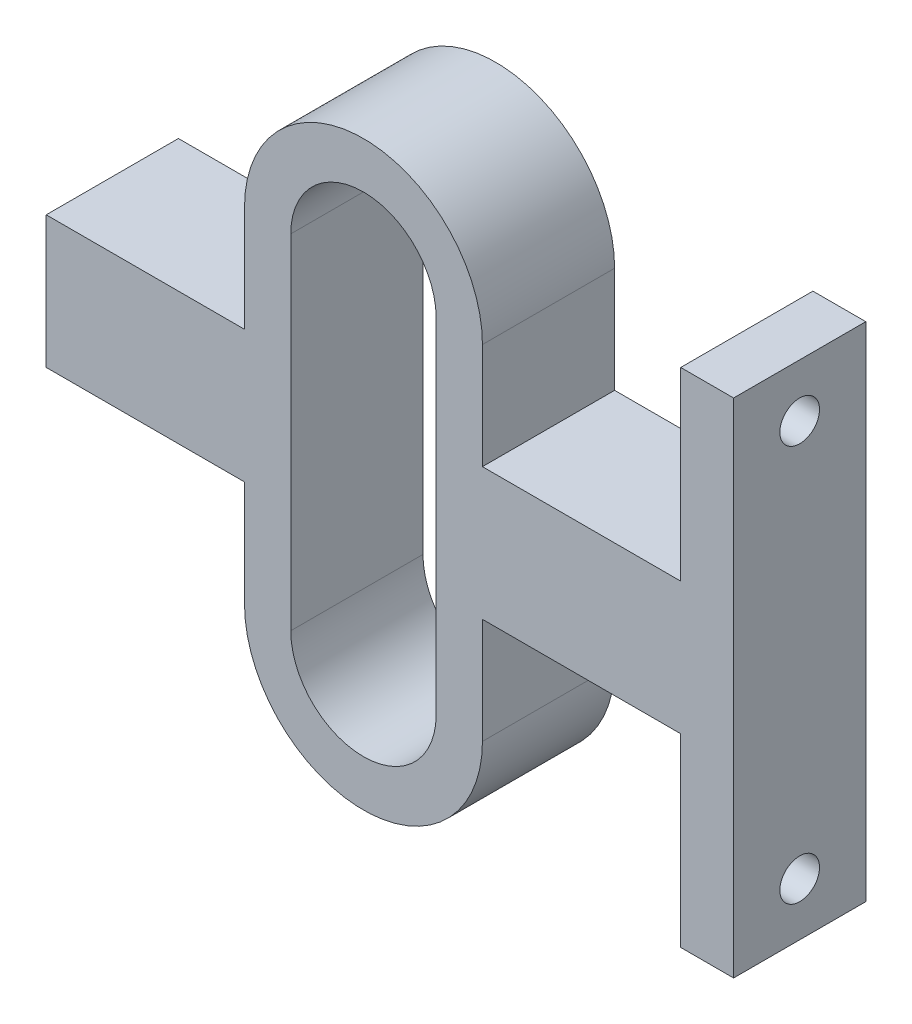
from build123d import *

# Parameters (mm, degrees)
BOSS_EXTRUDE1_DEPTH = 10
SKETCH7_R           = 1.5
CUT_EXTRUDE1_DEPTH  = 10


with BuildPart() as part:
    # Sketch1 → Boss-Extrude1 (new body)
    with BuildSketch(Plane.XY):
        with BuildLine():
            Line((-9, 5), (-9, 13))
            ThreePointArc((-9, 13), (0, 22), (9, 13))
            Line((9, 13), (9, 5))
            Line((9, 5), (24, 5))
            Line((24, 5), (24, 19))
            Line((24, 19), (28, 19))
            Line((28, 19), (28, -19))
            Line((28, -19), (24, -19))
            Line((24, -19), (24, -5))
            Line((24, -5), (9, -5))
            Line((9, -5), (9, -13))
            ThreePointArc((9, -13), (0, -22), (-9, -13))
            Line((-9, -13), (-9, -5))
            Line((-9, -5), (-24, -5))
            Line((-24, -5), (-24, 5))
            Line((-24, 5), (-9, 5))
        make_face()
        with BuildLine():
            Line((-5.5, 13), (-5.5, -13))
            ThreePointArc((-5.5, -13), (0, -18.5), (5.5, -13))
            Line((5.5, -13), (5.5, 13))
            ThreePointArc((5.5, 13), (0, 18.5), (-5.5, 13))
        make_face(mode=Mode.SUBTRACT)
    extrude(amount=BOSS_EXTRUDE1_DEPTH)

    # Sketch7 → Cut-Extrude1 (cut)
    with BuildSketch(Plane(origin=(28, 0, 0), x_dir=(0, 0, -1), z_dir=(1, 0, 0))):
        with Locations((-5, 15)):
            Circle(SKETCH7_R)
        with Locations((-5, -15)):
            Circle(SKETCH7_R)
    extrude(amount=-CUT_EXTRUDE1_DEPTH, mode=Mode.SUBTRACT)


solid = part.part
